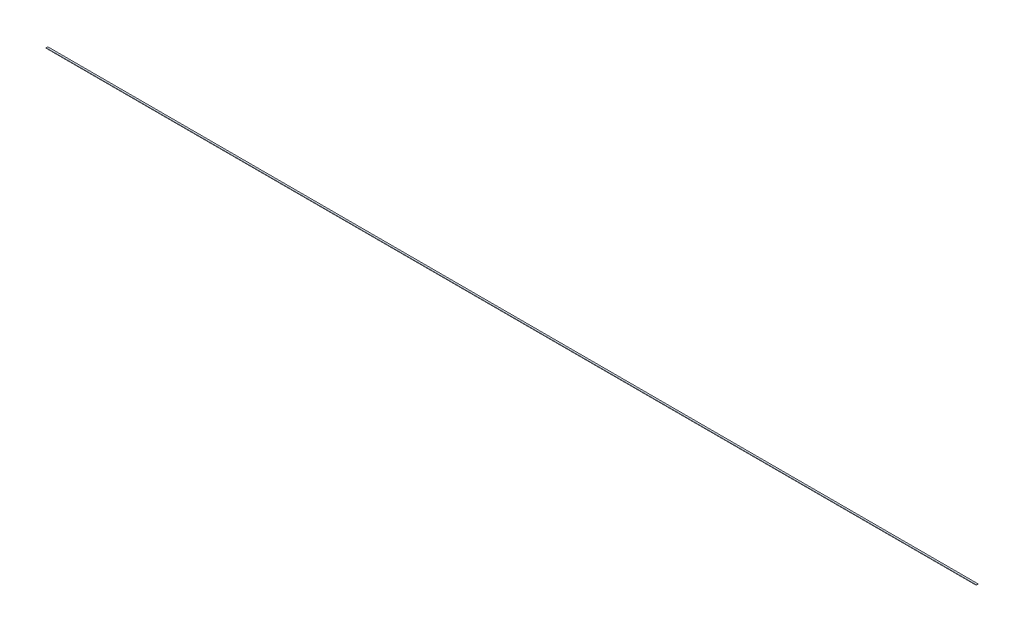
from build123d import *

# Parameters (mm, degrees)
ESQUISSE1_W        = 510000
ESQUISSE1_H        = 200
BOSS_EXTRU_1_DEPTH = 1000


with BuildPart() as part:
    # Esquisse1 → Boss.-Extru.1 (new body)
    with BuildSketch(Plane.XY):
        with Locations((241101.056608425, 5158.801682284)):
            Rectangle(ESQUISSE1_W, ESQUISSE1_H)
    extrude(amount=BOSS_EXTRU_1_DEPTH)


solid = part.part
